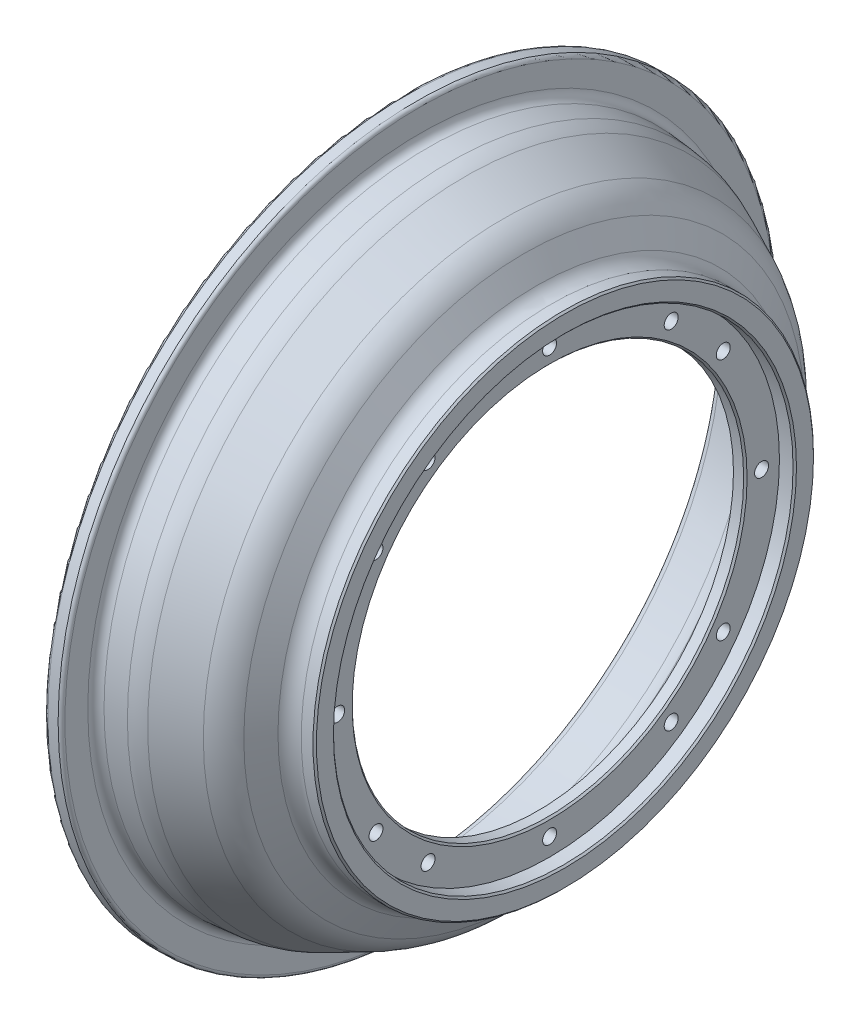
ISO-10303-21;
HEADER;
FILE_DESCRIPTION(('STEP AP214'),'2;1');
FILE_NAME('part.step','',(''),(''),'','','');
FILE_SCHEMA(('AUTOMOTIVE_DESIGN { 1 0 10303 214 1 1 1 1 }'));
ENDSEC;
DATA;
#1=APPLICATION_CONTEXT('core data for automotive mechanical design processes');
#2=APPLICATION_PROTOCOL_DEFINITION('international standard','automotive_design',2000,#1);
#3=PRODUCT_CONTEXT('',#1,'mechanical');
#4=PRODUCT('Part','Part','',(#3));
#5=PRODUCT_RELATED_PRODUCT_CATEGORY('part','',(#4));
#6=PRODUCT_DEFINITION_FORMATION('','',#4);
#7=PRODUCT_DEFINITION_CONTEXT('part definition',#1,'design');
#8=PRODUCT_DEFINITION('design','',#6,#7);
#9=PRODUCT_DEFINITION_SHAPE('','',#8);
#10=(LENGTH_UNIT() NAMED_UNIT(*) SI_UNIT(.MILLI.,.METRE.));
#11=(NAMED_UNIT(*) PLANE_ANGLE_UNIT() SI_UNIT($,.RADIAN.));
#12=(NAMED_UNIT(*) SI_UNIT($,.STERADIAN.) SOLID_ANGLE_UNIT());
#13=UNCERTAINTY_MEASURE_WITH_UNIT(LENGTH_MEASURE(1.E-05),#10,'distance_accuracy_value','');
#14=(GEOMETRIC_REPRESENTATION_CONTEXT(3) GLOBAL_UNCERTAINTY_ASSIGNED_CONTEXT((#13)) GLOBAL_UNIT_ASSIGNED_CONTEXT((#10,
#11,#12)) REPRESENTATION_CONTEXT('',''));
#15=CARTESIAN_POINT('',(0.,0.,0.));
#16=DIRECTION('',(0.,0.,1.));
#17=DIRECTION('',(1.,0.,0.));
#18=AXIS2_PLACEMENT_3D('',#15,#16,#17);
#19=CARTESIAN_POINT('',(0.,135.,0.));
#20=DIRECTION('',(1.,0.,0.));
#21=DIRECTION('',(0.,0.,-1.));
#22=AXIS2_PLACEMENT_3D('',#19,#20,#21);
#23=PLANE('',#22);
#24=CARTESIAN_POINT('',(0.,0.,0.));
#25=DIRECTION('',(1.,0.,0.));
#26=DIRECTION('',(0.,0.,-1.));
#27=AXIS2_PLACEMENT_3D('',#24,#25,#26);
#28=CIRCLE('',#27,136.);
#29=CARTESIAN_POINT('',(0.,0.,-136.));
#30=VERTEX_POINT('',#29);
#31=EDGE_CURVE('E87',#30,#30,#28,.F.);
#32=ORIENTED_EDGE('',*,*,#31,.T.);
#33=EDGE_LOOP('',(#32));
#34=FACE_BOUND('',#33,.T.);
#35=CARTESIAN_POINT('',(0.,0.,0.));
#36=DIRECTION('',(1.,0.,0.));
#37=DIRECTION('',(0.,0.,-1.));
#38=AXIS2_PLACEMENT_3D('',#35,#36,#37);
#39=CIRCLE('',#38,146.);
#40=CARTESIAN_POINT('',(0.,0.,-146.));
#41=VERTEX_POINT('',#40);
#42=EDGE_CURVE('E90',#41,#41,#39,.T.);
#43=ORIENTED_EDGE('',*,*,#42,.T.);
#44=EDGE_LOOP('',(#43));
#45=FACE_BOUND('',#44,.T.);
#46=ADVANCED_FACE('F41',(#34,#45),#23,.T.);
#47=CARTESIAN_POINT('',(0.,0.,0.));
#48=DIRECTION('',(1.,0.,0.));
#49=DIRECTION('',(0.,0.,-1.));
#50=AXIS2_PLACEMENT_3D('',#47,#48,#49);
#51=CYLINDRICAL_SURFACE('',#50,135.);
#52=CARTESIAN_POINT('',(-1.0000000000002,0.,0.));
#53=DIRECTION('',(1.,0.,0.));
#54=DIRECTION('',(0.,0.,-1.));
#55=AXIS2_PLACEMENT_3D('',#52,#53,#54);
#56=CIRCLE('',#55,135.);
#57=CARTESIAN_POINT('',(-1.0000000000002,0.,-135.));
#58=VERTEX_POINT('',#57);
#59=EDGE_CURVE('E93',#58,#58,#56,.T.);
#60=ORIENTED_EDGE('',*,*,#59,.T.);
#61=EDGE_LOOP('',(#60));
#62=FACE_BOUND('',#61,.T.);
#63=CARTESIAN_POINT('',(-9.,0.,0.));
#64=DIRECTION('',(1.,0.,0.));
#65=DIRECTION('',(0.,0.,-1.));
#66=AXIS2_PLACEMENT_3D('',#63,#64,#65);
#67=CIRCLE('',#66,135.);
#68=CARTESIAN_POINT('',(-9.,0.,-135.));
#69=VERTEX_POINT('',#68);
#70=EDGE_CURVE('E132',#69,#69,#67,.T.);
#71=ORIENTED_EDGE('',*,*,#70,.F.);
#72=EDGE_LOOP('',(#71));
#73=FACE_BOUND('',#72,.T.);
#74=ADVANCED_FACE('F311',(#62,#73),#51,.F.);
#75=CARTESIAN_POINT('',(-9.,135.,0.));
#76=DIRECTION('',(1.,0.,0.));
#77=DIRECTION('',(0.,0.,-1.));
#78=AXIS2_PLACEMENT_3D('',#75,#76,#77);
#79=PLANE('',#78);
#80=CARTESIAN_POINT('',(-9.,0.,0.));
#81=DIRECTION('',(1.,0.,0.));
#82=DIRECTION('',(0.,0.,-1.));
#83=AXIS2_PLACEMENT_3D('',#80,#81,#82);
#84=CIRCLE('',#83,116.);
#85=CARTESIAN_POINT('',(-9.,0.,-116.));
#86=VERTEX_POINT('',#85);
#87=EDGE_CURVE('E96',#86,#86,#84,.F.);
#88=ORIENTED_EDGE('',*,*,#87,.T.);
#89=EDGE_LOOP('',(#88));
#90=FACE_BOUND('',#89,.T.);
#91=CARTESIAN_POINT('',(-9.,-4.3468942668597E-13,124.5));
#92=DIRECTION('',(1.,0.,0.));
#93=DIRECTION('',(0.,0.,-1.));
#94=AXIS2_PLACEMENT_3D('',#91,#92,#93);
#95=CIRCLE('',#94,4.1);
#96=CARTESIAN_POINT('',(-9.,-4.3468942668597E-13,120.4));
#97=VERTEX_POINT('',#96);
#98=EDGE_CURVE('E152',#97,#97,#95,.T.);
#99=ORIENTED_EDGE('',*,*,#98,.F.);
#100=EDGE_LOOP('',(#99));
#101=FACE_BOUND('',#100,.T.);
#102=CARTESIAN_POINT('',(-9.,101.98442951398,-71.4102663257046));
#103=DIRECTION('',(1.,0.,0.));
#104=DIRECTION('',(0.,0.,-1.));
#105=AXIS2_PLACEMENT_3D('',#102,#103,#104);
#106=CIRCLE('',#105,4.1);
#107=CARTESIAN_POINT('',(-9.,101.98442951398,-75.5102663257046));
#108=VERTEX_POINT('',#107);
#109=EDGE_CURVE('E159',#108,#108,#106,.T.);
#110=ORIENTED_EDGE('',*,*,#109,.F.);
#111=EDGE_LOOP('',(#110));
#112=FACE_BOUND('',#111,.T.);
#113=CARTESIAN_POINT('',(-9.,71.4102663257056,-101.984429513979));
#114=DIRECTION('',(1.,0.,0.));
#115=DIRECTION('',(0.,0.,-1.));
#116=AXIS2_PLACEMENT_3D('',#113,#114,#115);
#117=CIRCLE('',#116,4.1);
#118=CARTESIAN_POINT('',(-9.,71.4102663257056,-106.084429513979));
#119=VERTEX_POINT('',#118);
#120=EDGE_CURVE('E162',#119,#119,#117,.T.);
#121=ORIENTED_EDGE('',*,*,#120,.F.);
#122=EDGE_LOOP('',(#121));
#123=FACE_BOUND('',#122,.T.);
#124=CARTESIAN_POINT('',(-9.,1.30406828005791E-12,-124.5));
#125=DIRECTION('',(1.,0.,0.));
#126=DIRECTION('',(0.,0.,-1.));
#127=AXIS2_PLACEMENT_3D('',#124,#125,#126);
#128=CIRCLE('',#127,4.1);
#129=CARTESIAN_POINT('',(-9.,1.30406828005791E-12,-128.6));
#130=VERTEX_POINT('',#129);
#131=EDGE_CURVE('E165',#130,#130,#128,.T.);
#132=ORIENTED_EDGE('',*,*,#131,.F.);
#133=EDGE_LOOP('',(#132));
#134=FACE_BOUND('',#133,.T.);
#135=CARTESIAN_POINT('',(-9.,-71.4102663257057,-101.984429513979));
#136=DIRECTION('',(1.,0.,0.));
#137=DIRECTION('',(0.,0.,-1.));
#138=AXIS2_PLACEMENT_3D('',#135,#136,#137);
#139=CIRCLE('',#138,4.1);
#140=CARTESIAN_POINT('',(-9.,-71.4102663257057,-106.084429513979));
#141=VERTEX_POINT('',#140);
#142=EDGE_CURVE('E168',#141,#141,#139,.T.);
#143=ORIENTED_EDGE('',*,*,#142,.F.);
#144=EDGE_LOOP('',(#143));
#145=FACE_BOUND('',#144,.T.);
#146=CARTESIAN_POINT('',(-9.,-101.98442951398,-71.4102663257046));
#147=DIRECTION('',(1.,0.,0.));
#148=DIRECTION('',(0.,0.,-1.));
#149=AXIS2_PLACEMENT_3D('',#146,#147,#148);
#150=CIRCLE('',#149,4.1);
#151=CARTESIAN_POINT('',(-9.,-101.98442951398,-75.5102663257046));
#152=VERTEX_POINT('',#151);
#153=EDGE_CURVE('E171',#152,#152,#150,.T.);
#154=ORIENTED_EDGE('',*,*,#153,.F.);
#155=EDGE_LOOP('',(#154));
#156=FACE_BOUND('',#155,.T.);
#157=CARTESIAN_POINT('',(-9.,-124.5,0.));
#158=DIRECTION('',(1.,0.,0.));
#159=DIRECTION('',(0.,0.,-1.));
#160=AXIS2_PLACEMENT_3D('',#157,#158,#159);
#161=CIRCLE('',#160,4.1);
#162=CARTESIAN_POINT('',(-9.,-124.5,-4.1));
#163=VERTEX_POINT('',#162);
#164=EDGE_CURVE('E174',#163,#163,#161,.T.);
#165=ORIENTED_EDGE('',*,*,#164,.F.);
#166=EDGE_LOOP('',(#165));
#167=FACE_BOUND('',#166,.T.);
#168=CARTESIAN_POINT('',(-9.,-101.984429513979,71.4102663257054));
#169=DIRECTION('',(1.,0.,0.));
#170=DIRECTION('',(0.,0.,-1.));
#171=AXIS2_PLACEMENT_3D('',#168,#169,#170);
#172=CIRCLE('',#171,4.1);
#173=CARTESIAN_POINT('',(-9.,-101.984429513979,67.3102663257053));
#174=VERTEX_POINT('',#173);
#175=EDGE_CURVE('E177',#174,#174,#172,.T.);
#176=ORIENTED_EDGE('',*,*,#175,.F.);
#177=EDGE_LOOP('',(#176));
#178=FACE_BOUND('',#177,.T.);
#179=CARTESIAN_POINT('',(-9.,-71.4102663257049,101.98442951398));
#180=DIRECTION('',(1.,0.,0.));
#181=DIRECTION('',(0.,0.,-1.));
#182=AXIS2_PLACEMENT_3D('',#179,#180,#181);
#183=CIRCLE('',#182,4.1);
#184=CARTESIAN_POINT('',(-9.,-71.4102663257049,97.8844295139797));
#185=VERTEX_POINT('',#184);
#186=EDGE_CURVE('E180',#185,#185,#183,.T.);
#187=ORIENTED_EDGE('',*,*,#186,.F.);
#188=EDGE_LOOP('',(#187));
#189=FACE_BOUND('',#188,.T.);
#190=CARTESIAN_POINT('',(-9.,124.5,0.));
#191=DIRECTION('',(1.,0.,0.));
#192=DIRECTION('',(0.,0.,-1.));
#193=AXIS2_PLACEMENT_3D('',#190,#191,#192);
#194=CIRCLE('',#193,4.1);
#195=CARTESIAN_POINT('',(-9.,124.5,-4.1));
#196=VERTEX_POINT('',#195);
#197=EDGE_CURVE('E138',#196,#196,#194,.T.);
#198=ORIENTED_EDGE('',*,*,#197,.F.);
#199=EDGE_LOOP('',(#198));
#200=FACE_BOUND('',#199,.T.);
#201=CARTESIAN_POINT('',(-9.,101.98442951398,71.4102663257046));
#202=DIRECTION('',(1.,0.,0.));
#203=DIRECTION('',(0.,0.,-1.));
#204=AXIS2_PLACEMENT_3D('',#201,#202,#203);
#205=CIRCLE('',#204,4.1);
#206=CARTESIAN_POINT('',(-9.,101.98442951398,67.3102663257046));
#207=VERTEX_POINT('',#206);
#208=EDGE_CURVE('E141',#207,#207,#205,.T.);
#209=ORIENTED_EDGE('',*,*,#208,.F.);
#210=EDGE_LOOP('',(#209));
#211=FACE_BOUND('',#210,.T.);
#212=CARTESIAN_POINT('',(-9.,71.4102663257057,101.984429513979));
#213=DIRECTION('',(1.,0.,0.));
#214=DIRECTION('',(0.,0.,-1.));
#215=AXIS2_PLACEMENT_3D('',#212,#213,#214);
#216=CIRCLE('',#215,4.1);
#217=CARTESIAN_POINT('',(-9.,71.4102663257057,97.8844295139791));
#218=VERTEX_POINT('',#217);
#219=EDGE_CURVE('E144',#218,#218,#216,.T.);
#220=ORIENTED_EDGE('',*,*,#219,.F.);
#221=EDGE_LOOP('',(#220));
#222=FACE_BOUND('',#221,.T.);
#223=ORIENTED_EDGE('',*,*,#70,.T.);
#224=EDGE_LOOP('',(#223));
#225=FACE_BOUND('',#224,.T.);
#226=ADVANCED_FACE('F317',(#90,#101,#112,#123,#134,#145,#156,#167,#178,#189,#200,#211,#222,
#225),#79,.T.);
#227=CARTESIAN_POINT('',(0.,0.,0.));
#228=DIRECTION('',(1.,0.,0.));
#229=DIRECTION('',(0.,0.,-1.));
#230=AXIS2_PLACEMENT_3D('',#227,#228,#229);
#231=CYLINDRICAL_SURFACE('',#230,115.);
#232=CARTESIAN_POINT('',(-10.,0.,0.));
#233=DIRECTION('',(1.,0.,0.));
#234=DIRECTION('',(0.,0.,-1.));
#235=AXIS2_PLACEMENT_3D('',#232,#233,#234);
#236=CIRCLE('',#235,115.);
#237=CARTESIAN_POINT('',(-10.,0.,-115.));
#238=VERTEX_POINT('',#237);
#239=EDGE_CURVE('E99',#238,#238,#236,.T.);
#240=ORIENTED_EDGE('',*,*,#239,.T.);
#241=EDGE_LOOP('',(#240));
#242=FACE_BOUND('',#241,.T.);
#243=CARTESIAN_POINT('',(-16.,0.,0.));
#244=DIRECTION('',(1.,0.,0.));
#245=DIRECTION('',(0.,0.,-1.));
#246=AXIS2_PLACEMENT_3D('',#243,#244,#245);
#247=CIRCLE('',#246,115.);
#248=CARTESIAN_POINT('',(-16.,0.,-115.));
#249=VERTEX_POINT('',#248);
#250=EDGE_CURVE('E135',#249,#249,#247,.T.);
#251=ORIENTED_EDGE('',*,*,#250,.F.);
#252=EDGE_LOOP('',(#251));
#253=FACE_BOUND('',#252,.T.);
#254=ADVANCED_FACE('F429',(#242,#253),#231,.F.);
#255=CARTESIAN_POINT('',(-16.,115.,0.));
#256=DIRECTION('',(-1.,0.,0.));
#257=DIRECTION('',(0.,0.,1.));
#258=AXIS2_PLACEMENT_3D('',#255,#256,#257);
#259=PLANE('',#258);
#260=CARTESIAN_POINT('',(-16.,0.,0.));
#261=DIRECTION('',(-1.,0.,0.));
#262=DIRECTION('',(0.,0.,1.));
#263=AXIS2_PLACEMENT_3D('',#260,#261,#262);
#264=CIRCLE('',#263,133.392304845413);
#265=CARTESIAN_POINT('',(-16.,0.,133.392304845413));
#266=VERTEX_POINT('',#265);
#267=EDGE_CURVE('E78',#266,#266,#264,.T.);
#268=ORIENTED_EDGE('',*,*,#267,.T.);
#269=EDGE_LOOP('',(#268));
#270=FACE_BOUND('',#269,.T.);
#271=CARTESIAN_POINT('',(-16.,-4.3468942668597E-13,124.5));
#272=DIRECTION('',(-1.,0.,0.));
#273=DIRECTION('',(0.,-1.,0.));
#274=AXIS2_PLACEMENT_3D('',#271,#272,#273);
#275=CIRCLE('',#274,4.1);
#276=CARTESIAN_POINT('',(-16.,-4.10000000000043,124.5));
#277=VERTEX_POINT('',#276);
#278=EDGE_CURVE('E183',#277,#277,#275,.T.);
#279=ORIENTED_EDGE('',*,*,#278,.F.);
#280=EDGE_LOOP('',(#279));
#281=FACE_BOUND('',#280,.T.);
#282=CARTESIAN_POINT('',(-16.,101.98442951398,-71.4102663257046));
#283=DIRECTION('',(-1.,0.,0.));
#284=DIRECTION('',(0.,1.,0.));
#285=AXIS2_PLACEMENT_3D('',#282,#283,#284);
#286=CIRCLE('',#285,4.1);
#287=CARTESIAN_POINT('',(-16.,106.08442951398,-71.4102663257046));
#288=VERTEX_POINT('',#287);
#289=EDGE_CURVE('E197',#288,#288,#286,.T.);
#290=ORIENTED_EDGE('',*,*,#289,.F.);
#291=EDGE_LOOP('',(#290));
#292=FACE_BOUND('',#291,.T.);
#293=CARTESIAN_POINT('',(-16.,71.4102663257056,-101.984429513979));
#294=DIRECTION('',(-1.,0.,0.));
#295=DIRECTION('',(0.,1.,0.));
#296=AXIS2_PLACEMENT_3D('',#293,#294,#295);
#297=CIRCLE('',#296,4.1);
#298=CARTESIAN_POINT('',(-16.,75.5102663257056,-101.984429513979));
#299=VERTEX_POINT('',#298);
#300=EDGE_CURVE('E200',#299,#299,#297,.T.);
#301=ORIENTED_EDGE('',*,*,#300,.F.);
#302=EDGE_LOOP('',(#301));
#303=FACE_BOUND('',#302,.T.);
#304=CARTESIAN_POINT('',(-16.,1.30406828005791E-12,-124.5));
#305=DIRECTION('',(-1.,0.,0.));
#306=DIRECTION('',(0.,1.,0.));
#307=AXIS2_PLACEMENT_3D('',#304,#305,#306);
#308=CIRCLE('',#307,4.1);
#309=CARTESIAN_POINT('',(-16.,4.1000000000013,-124.5));
#310=VERTEX_POINT('',#309);
#311=EDGE_CURVE('E204',#310,#310,#308,.T.);
#312=ORIENTED_EDGE('',*,*,#311,.F.);
#313=EDGE_LOOP('',(#312));
#314=FACE_BOUND('',#313,.T.);
#315=CARTESIAN_POINT('',(-16.,-71.4102663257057,-101.984429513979));
#316=DIRECTION('',(-1.,0.,0.));
#317=DIRECTION('',(0.,0.,-1.));
#318=AXIS2_PLACEMENT_3D('',#315,#316,#317);
#319=CIRCLE('',#318,4.1);
#320=CARTESIAN_POINT('',(-16.,-71.4102663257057,-106.084429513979));
#321=VERTEX_POINT('',#320);
#322=EDGE_CURVE('E188',#321,#321,#319,.T.);
#323=ORIENTED_EDGE('',*,*,#322,.F.);
#324=EDGE_LOOP('',(#323));
#325=FACE_BOUND('',#324,.T.);
#326=CARTESIAN_POINT('',(-16.,-101.98442951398,-71.4102663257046));
#327=DIRECTION('',(-1.,0.,0.));
#328=DIRECTION('',(0.,0.,-1.));
#329=AXIS2_PLACEMENT_3D('',#326,#327,#328);
#330=CIRCLE('',#329,4.1);
#331=CARTESIAN_POINT('',(-16.,-101.98442951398,-75.5102663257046));
#332=VERTEX_POINT('',#331);
#333=EDGE_CURVE('E184',#332,#332,#330,.T.);
#334=ORIENTED_EDGE('',*,*,#333,.F.);
#335=EDGE_LOOP('',(#334));
#336=FACE_BOUND('',#335,.T.);
#337=CARTESIAN_POINT('',(-16.,-124.5,0.));
#338=DIRECTION('',(-1.,0.,0.));
#339=DIRECTION('',(0.,0.,-1.));
#340=AXIS2_PLACEMENT_3D('',#337,#338,#339);
#341=CIRCLE('',#340,4.1);
#342=CARTESIAN_POINT('',(-16.,-124.5,-4.1));
#343=VERTEX_POINT('',#342);
#344=EDGE_CURVE('E187',#343,#343,#341,.T.);
#345=ORIENTED_EDGE('',*,*,#344,.F.);
#346=EDGE_LOOP('',(#345));
#347=FACE_BOUND('',#346,.T.);
#348=CARTESIAN_POINT('',(-16.,-101.984429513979,71.4102663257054));
#349=DIRECTION('',(-1.,0.,0.));
#350=DIRECTION('',(0.,-1.,0.));
#351=AXIS2_PLACEMENT_3D('',#348,#349,#350);
#352=CIRCLE('',#351,4.1);
#353=CARTESIAN_POINT('',(-16.,-106.084429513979,71.4102663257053));
#354=VERTEX_POINT('',#353);
#355=EDGE_CURVE('E191',#354,#354,#352,.T.);
#356=ORIENTED_EDGE('',*,*,#355,.F.);
#357=EDGE_LOOP('',(#356));
#358=FACE_BOUND('',#357,.T.);
#359=CARTESIAN_POINT('',(-16.,-71.4102663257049,101.98442951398));
#360=DIRECTION('',(-1.,0.,0.));
#361=DIRECTION('',(0.,-1.,0.));
#362=AXIS2_PLACEMENT_3D('',#359,#360,#361);
#363=CIRCLE('',#362,4.1);
#364=CARTESIAN_POINT('',(-16.,-75.5102663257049,101.98442951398));
#365=VERTEX_POINT('',#364);
#366=EDGE_CURVE('E194',#365,#365,#363,.T.);
#367=ORIENTED_EDGE('',*,*,#366,.F.);
#368=EDGE_LOOP('',(#367));
#369=FACE_BOUND('',#368,.T.);
#370=CARTESIAN_POINT('',(-16.,124.5,0.));
#371=DIRECTION('',(-1.,0.,0.));
#372=DIRECTION('',(0.,0.,1.));
#373=AXIS2_PLACEMENT_3D('',#370,#371,#372);
#374=CIRCLE('',#373,4.1);
#375=CARTESIAN_POINT('',(-16.,124.5,4.1));
#376=VERTEX_POINT('',#375);
#377=EDGE_CURVE('E147',#376,#376,#374,.T.);
#378=ORIENTED_EDGE('',*,*,#377,.F.);
#379=EDGE_LOOP('',(#378));
#380=FACE_BOUND('',#379,.T.);
#381=CARTESIAN_POINT('',(-16.,101.98442951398,71.4102663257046));
#382=DIRECTION('',(-1.,0.,0.));
#383=DIRECTION('',(0.,0.,1.));
#384=AXIS2_PLACEMENT_3D('',#381,#382,#383);
#385=CIRCLE('',#384,4.1);
#386=CARTESIAN_POINT('',(-16.,101.98442951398,75.5102663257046));
#387=VERTEX_POINT('',#386);
#388=EDGE_CURVE('E151',#387,#387,#385,.T.);
#389=ORIENTED_EDGE('',*,*,#388,.F.);
#390=EDGE_LOOP('',(#389));
#391=FACE_BOUND('',#390,.T.);
#392=CARTESIAN_POINT('',(-16.,71.4102663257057,101.984429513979));
#393=DIRECTION('',(-1.,0.,0.));
#394=DIRECTION('',(0.,0.,1.));
#395=AXIS2_PLACEMENT_3D('',#392,#393,#394);
#396=CIRCLE('',#395,4.1);
#397=CARTESIAN_POINT('',(-16.,71.4102663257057,106.084429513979));
#398=VERTEX_POINT('',#397);
#399=EDGE_CURVE('E148',#398,#398,#396,.T.);
#400=ORIENTED_EDGE('',*,*,#399,.F.);
#401=EDGE_LOOP('',(#400));
#402=FACE_BOUND('',#401,.T.);
#403=ORIENTED_EDGE('',*,*,#250,.T.);
#404=EDGE_LOOP('',(#403));
#405=FACE_BOUND('',#404,.T.);
#406=ADVANCED_FACE('F422',(#270,#281,#292,#303,#314,#325,#336,#347,#358,#369,#380,#391,#402,
#405),#259,.T.);
#407=CARTESIAN_POINT('',(-33.9952238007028,0.,0.));
#408=DIRECTION('',(-1.,0.,0.));
#409=DIRECTION('',(0.,0.,1.));
#410=AXIS2_PLACEMENT_3D('',#407,#408,#409);
#411=CONICAL_SURFACE('',#410,166.16864191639,1.0471975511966);
#412=CARTESIAN_POINT('',(-16.8038475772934,0.,0.));
#413=DIRECTION('',(-1.,0.,0.));
#414=DIRECTION('',(0.,0.,1.));
#415=AXIS2_PLACEMENT_3D('',#412,#413,#414);
#416=CIRCLE('',#415,136.392304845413);
#417=CARTESIAN_POINT('',(-16.8038475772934,0.,136.392304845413));
#418=VERTEX_POINT('',#417);
#419=EDGE_CURVE('E81',#418,#418,#416,.F.);
#420=ORIENTED_EDGE('',*,*,#419,.T.);
#421=EDGE_LOOP('',(#420));
#422=FACE_BOUND('',#421,.T.);
#423=CARTESIAN_POINT('',(-30.8422359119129,0.,0.));
#424=DIRECTION('',(-1.,0.,0.));
#425=DIRECTION('',(0.,0.,1.));
#426=AXIS2_PLACEMENT_3D('',#423,#424,#425);
#427=CIRCLE('',#426,160.707506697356);
#428=CARTESIAN_POINT('',(-30.8422359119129,0.,160.707506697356));
#429=VERTEX_POINT('',#428);
#430=EDGE_CURVE('E120',#429,#429,#427,.T.);
#431=ORIENTED_EDGE('',*,*,#430,.T.);
#432=EDGE_LOOP('',(#431));
#433=FACE_BOUND('',#432,.T.);
#434=ADVANCED_FACE('F307',(#422,#433),#411,.F.);
#435=CARTESIAN_POINT('',(-65.2,0.,0.));
#436=DIRECTION('',(-1.,0.,0.));
#437=DIRECTION('',(0.,0.,1.));
#438=AXIS2_PLACEMENT_3D('',#435,#436,#437);
#439=CONICAL_SURFACE('',#438,180.719668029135,0.436332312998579);
#440=CARTESIAN_POINT('',(-56.0266463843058,-1.87432316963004,-176.432107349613));
#441=CARTESIAN_POINT('',(-55.9795709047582,-2.03446837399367,-176.408453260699));
#442=CARTESIAN_POINT('',(-55.9264549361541,-2.19237160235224,-176.381786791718));
#443=CARTESIAN_POINT('',(-55.8084796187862,-2.50266424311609,-176.322638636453));
#444=CARTESIAN_POINT('',(-55.7436172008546,-2.65505220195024,-176.290155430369));
#445=CARTESIAN_POINT('',(-55.6025418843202,-2.95330771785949,-176.219617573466));
#446=CARTESIAN_POINT('',(-55.5263189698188,-3.09916937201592,-176.181558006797));
#447=CARTESIAN_POINT('',(-55.3630572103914,-3.38324681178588,-176.100187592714));
#448=CARTESIAN_POINT('',(-55.2760144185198,-3.52145978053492,-176.056874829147));
#449=CARTESIAN_POINT('',(-55.0918119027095,-3.78908366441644,-175.965403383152));
#450=CARTESIAN_POINT('',(-54.994660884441,-3.91850199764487,-175.917248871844));
#451=CARTESIAN_POINT('',(-54.7908101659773,-4.16779337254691,-175.816435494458));
#452=CARTESIAN_POINT('',(-54.6841069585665,-4.28766287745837,-175.763774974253));
#453=CARTESIAN_POINT('',(-54.4619859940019,-4.51688091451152,-175.65442283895));
#454=CARTESIAN_POINT('',(-54.3465736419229,-4.62623587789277,-175.597733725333));
#455=CARTESIAN_POINT('',(-54.1077285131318,-4.83377036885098,-175.480725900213));
#456=CARTESIAN_POINT('',(-53.9842927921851,-4.93194575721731,-175.420405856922));
#457=CARTESIAN_POINT('',(-53.7303085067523,-5.11636567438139,-175.296638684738));
#458=CARTESIAN_POINT('',(-53.5997607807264,-5.202611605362,-175.23319192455));
#459=CARTESIAN_POINT('',(-53.3323960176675,-5.36260253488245,-175.103636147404));
#460=CARTESIAN_POINT('',(-53.1955766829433,-5.43634290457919,-175.037526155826));
#461=CARTESIAN_POINT('',(-52.9167136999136,-5.57073630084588,-174.903198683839));
#462=CARTESIAN_POINT('',(-52.7746717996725,-5.63139366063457,-174.8349819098));
#463=CARTESIAN_POINT('',(-52.4862611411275,-5.73923996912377,-174.696914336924));
#464=CARTESIAN_POINT('',(-52.3398908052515,-5.78642393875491,-174.627062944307));
#465=CARTESIAN_POINT('',(-52.044001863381,-5.86692913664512,-174.486323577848));
#466=CARTESIAN_POINT('',(-51.894485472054,-5.90025979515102,-174.415436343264));
#467=CARTESIAN_POINT('',(-51.5932090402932,-5.95287806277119,-174.273079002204));
#468=CARTESIAN_POINT('',(-51.4414481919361,-5.97216048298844,-174.201608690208));
#469=CARTESIAN_POINT('',(-51.1368539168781,-5.99651538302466,-174.0586532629));
#470=CARTESIAN_POINT('',(-50.9840209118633,-6.00159316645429,-173.987168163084));
#471=CARTESIAN_POINT('',(-50.6783068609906,-5.99753402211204,-173.844666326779));
#472=CARTESIAN_POINT('',(-50.5254258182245,-5.98839184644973,-173.773649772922));
#473=CARTESIAN_POINT('',(-50.0685793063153,-5.93967799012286,-173.562169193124));
#474=CARTESIAN_POINT('',(-49.7659638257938,-5.87885422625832,-173.423064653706));
#475=CARTESIAN_POINT('',(-49.1737771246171,-5.70220948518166,-173.152671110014));
#476=CARTESIAN_POINT('',(-48.8842058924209,-5.58638855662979,-173.021382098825));
#477=CARTESIAN_POINT('',(-48.3261907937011,-5.30302346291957,-172.769969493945));
#478=CARTESIAN_POINT('',(-48.0577496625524,-5.13547261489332,-172.649847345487));
#479=CARTESIAN_POINT('',(-47.5498635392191,-4.7534079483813,-172.423867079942));
#480=CARTESIAN_POINT('',(-47.3104186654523,-4.53889393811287,-172.318009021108));
#481=CARTESIAN_POINT('',(-46.8673860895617,-4.06888060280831,-172.123100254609));
#482=CARTESIAN_POINT('',(-46.6638141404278,-3.81336336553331,-172.034056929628));
#483=CARTESIAN_POINT('',(-46.2986284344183,-3.26865602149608,-171.874948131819));
#484=CARTESIAN_POINT('',(-46.1370146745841,-2.97946591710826,-171.804882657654));
#485=CARTESIAN_POINT('',(-45.8605010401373,-2.3755970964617,-171.685340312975));
#486=CARTESIAN_POINT('',(-45.7456038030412,-2.06091694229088,-171.635864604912));
#487=CARTESIAN_POINT('',(-45.5659418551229,-1.41501568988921,-171.558623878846));
#488=CARTESIAN_POINT('',(-45.5011770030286,-1.08379463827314,-171.530858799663));
#489=CARTESIAN_POINT('',(-45.423721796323,-0.414363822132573,-171.497663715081));
#490=CARTESIAN_POINT('',(-45.4110094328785,-0.0761570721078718,-171.492224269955));
#491=CARTESIAN_POINT('',(-45.4379770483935,0.597775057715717,-171.503774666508));
#492=CARTESIAN_POINT('',(-45.4776569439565,0.933500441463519,-171.520764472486));
#493=CARTESIAN_POINT('',(-45.608213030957,1.59285871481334,-171.576790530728));
#494=CARTESIAN_POINT('',(-45.6990771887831,1.91649442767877,-171.615821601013));
#495=CARTESIAN_POINT('',(-45.9292987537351,2.54257856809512,-171.715053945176));
#496=CARTESIAN_POINT('',(-46.06865627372,2.8450269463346,-171.775255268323));
#497=CARTESIAN_POINT('',(-46.3918033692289,3.42025953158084,-171.915481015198));
#498=CARTESIAN_POINT('',(-46.5756074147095,3.69303403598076,-171.995511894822));
#499=CARTESIAN_POINT('',(-46.9822236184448,4.2010757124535,-172.173518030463));
#500=CARTESIAN_POINT('',(-47.2050358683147,4.43634279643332,-172.271493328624));
#501=CARTESIAN_POINT('',(-47.6832481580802,4.86277972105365,-172.483067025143));
#502=CARTESIAN_POINT('',(-47.9386602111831,5.05393323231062,-172.596671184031));
#503=CARTESIAN_POINT('',(-48.4745852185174,5.38660260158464,-172.836637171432));
#504=CARTESIAN_POINT('',(-48.7550981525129,5.52811849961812,-172.962998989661));
#505=CARTESIAN_POINT('',(-49.3330680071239,5.75747100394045,-173.225177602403));
#506=CARTESIAN_POINT('',(-49.6305220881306,5.84531657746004,-173.360992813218));
#507=CARTESIAN_POINT('',(-50.2338908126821,5.96485718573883,-173.638442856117));
#508=CARTESIAN_POINT('',(-50.5398054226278,5.99655244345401,-173.780077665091));
#509=CARTESIAN_POINT('',(-51.1511888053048,6.00291454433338,-174.065120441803));
#510=CARTESIAN_POINT('',(-51.4566577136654,5.97760605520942,-174.208527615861));
#511=CARTESIAN_POINT('',(-52.0588361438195,5.87063587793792,-174.49312465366));
#512=CARTESIAN_POINT('',(-52.3555456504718,5.7889740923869,-174.634314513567));
#513=CARTESIAN_POINT('',(-52.7874110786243,5.62617190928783,-174.841093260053));
#514=CARTESIAN_POINT('',(-52.9292375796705,5.5651435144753,-174.909219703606));
#515=CARTESIAN_POINT('',(-53.2075887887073,5.43007055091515,-175.043325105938));
#516=CARTESIAN_POINT('',(-53.3441154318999,5.35603078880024,-175.109304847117));
#517=CARTESIAN_POINT('',(-53.6109685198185,5.19542404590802,-175.238633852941));
#518=CARTESIAN_POINT('',(-53.7412926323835,5.10885240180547,-175.301982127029));
#519=CARTESIAN_POINT('',(-53.9947495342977,4.9238499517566,-175.425511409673));
#520=CARTESIAN_POINT('',(-54.1178849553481,4.82542352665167,-175.485693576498));
#521=CARTESIAN_POINT('',(-54.3562578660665,4.61730138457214,-175.602486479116));
#522=CARTESIAN_POINT('',(-54.4714889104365,4.50759664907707,-175.659094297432));
#523=CARTESIAN_POINT('',(-54.6931087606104,4.27780565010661,-175.768214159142));
#524=CARTESIAN_POINT('',(-54.7995008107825,4.15772322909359,-175.820727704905));
#525=CARTESIAN_POINT('',(-55.0027915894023,3.90795304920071,-175.921276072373));
#526=CARTESIAN_POINT('',(-55.0996871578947,3.77826211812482,-175.96930940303));
#527=CARTESIAN_POINT('',(-55.2832452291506,3.51028073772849,-176.060470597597));
#528=CARTESIAN_POINT('',(-55.3699114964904,3.37199348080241,-176.103600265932));
#529=CARTESIAN_POINT('',(-55.5324966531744,3.08769075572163,-176.184640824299));
#530=CARTESIAN_POINT('',(-55.6084104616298,2.94167167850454,-176.22254924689));
#531=CARTESIAN_POINT('',(-55.7488959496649,2.6430580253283,-176.292797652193));
#532=CARTESIAN_POINT('',(-55.8134718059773,2.4904658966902,-176.325139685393));
#533=CARTESIAN_POINT('',(-55.930909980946,2.17964413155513,-176.384022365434));
#534=CARTESIAN_POINT('',(-55.9837650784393,2.0214110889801,-176.410559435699));
#535=CARTESIAN_POINT('',(-56.0773319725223,1.70058159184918,-176.45757681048));
#536=CARTESIAN_POINT('',(-56.1180482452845,1.5379867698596,-176.478059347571));
#537=CARTESIAN_POINT('',(-56.1871033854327,1.20944754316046,-176.512818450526));
#538=CARTESIAN_POINT('',(-56.2154357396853,1.04350142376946,-176.527091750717));
#539=CARTESIAN_POINT('',(-56.2594900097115,0.709586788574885,-176.549292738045));
#540=CARTESIAN_POINT('',(-56.2752165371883,0.541619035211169,-176.557222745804));
#541=CARTESIAN_POINT('',(-56.2939599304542,0.204942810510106,-176.566674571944));
#542=CARTESIAN_POINT('',(-56.2969880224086,0.0362351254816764,-176.568202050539));
#543=CARTESIAN_POINT('',(-56.2903480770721,-0.300811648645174,-176.564853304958));
#544=CARTESIAN_POINT('',(-56.2806833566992,-0.469150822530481,-176.559978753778));
#545=CARTESIAN_POINT('',(-56.24466136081,-0.846922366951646,-176.541818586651));
#546=CARTESIAN_POINT('',(-56.214688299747,-1.05593407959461,-176.526711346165));
#547=CARTESIAN_POINT('',(-56.1351904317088,-1.46924623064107,-176.486683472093));
#548=CARTESIAN_POINT('',(-56.0856656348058,-1.67354667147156,-176.461762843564));
#549=CARTESIAN_POINT('',(-56.0266463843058,-1.87432316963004,-176.432107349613));
#550=B_SPLINE_CURVE_WITH_KNOTS('',3,(#440,#441,#442,#443,#444,#445,#446,#447,#448,#449,#450,
#451,#452,#453,#454,#455,#456,#457,#458,#459,#460,#461,#462,#463,#464,#465,#466,#467,#468,#469,
#470,#471,#472,#473,#474,#475,#476,#477,#478,#479,#480,#481,#482,#483,#484,#485,#486,#487,#488,
#489,#490,#491,#492,#493,#494,#495,#496,#497,#498,#499,#500,#501,#502,#503,#504,#505,#506,#507,
#508,#509,#510,#511,#512,#513,#514,#515,#516,#517,#518,#519,#520,#521,#522,#523,#524,#525,#526,
#527,#528,#529,#530,#531,#532,#533,#534,#535,#536,#537,#538,#539,#540,#541,#542,#543,#544,#545,
#546,#547,#548,#549),.UNSPECIFIED.,.T.,.F.,(4,2,2,2,2,2,2,2,2,2,2,2,2,2,2,2,2,2,2,2,2,2,2,2,2,2,
2,2,2,2,2,2,2,2,2,2,2,2,2,2,2,2,2,2,2,2,2,2,2,2,2,2,2,2,4),(0.,0.50558098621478,
1.01129426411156,1.51745606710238,2.02380305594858,2.52971750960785,3.03581848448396,
3.54160790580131,4.04758398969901,4.55350055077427,5.0596039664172,5.56553949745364,
6.07166175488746,6.57743891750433,7.08340280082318,7.58917774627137,8.09513939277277,
9.105597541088,10.1160547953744,11.1266426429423,12.1372346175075,13.1482692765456,
14.1593038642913,15.1703955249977,16.1814843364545,17.1921455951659,18.2028052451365,
19.2132273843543,20.2236518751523,21.2344057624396,22.2451620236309,23.2562918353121,
24.2674208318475,25.2783808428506,26.2893368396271,27.2998554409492,28.3103757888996,
28.8161686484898,29.3217750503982,29.8275700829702,30.3331787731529,30.8391949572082,
31.345024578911,31.8510219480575,32.3568325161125,32.8628813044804,33.368743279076,
33.8749160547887,34.3809019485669,34.8871536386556,35.3932200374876,35.8988389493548,
36.404325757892,37.0381807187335,37.6720353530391),.UNSPECIFIED.);
#551=CARTESIAN_POINT('',(-56.0266463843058,-1.87432316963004,-176.432107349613));
#552=VERTEX_POINT('',#551);
#553=EDGE_CURVE('E201',#552,#552,#550,.T.);
#554=ORIENTED_EDGE('',*,*,#553,.F.);
#555=EDGE_LOOP('',(#554));
#556=FACE_BOUND('',#555,.T.);
#557=CARTESIAN_POINT('',(-62.0038696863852,0.,0.));
#558=DIRECTION('',(-1.,0.,0.));
#559=DIRECTION('',(0.,0.,1.));
#560=AXIS2_PLACEMENT_3D('',#557,#558,#559);
#561=CIRCLE('',#560,179.229287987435);
#562=CARTESIAN_POINT('',(-62.0038696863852,0.,179.229287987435));
#563=VERTEX_POINT('',#562);
#564=EDGE_CURVE('E123',#563,#563,#561,.T.);
#565=ORIENTED_EDGE('',*,*,#564,.T.);
#566=EDGE_LOOP('',(#565));
#567=FACE_BOUND('',#566,.T.);
#568=CARTESIAN_POINT('',(-39.7103787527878,0.,0.));
#569=DIRECTION('',(-1.,0.,0.));
#570=DIRECTION('',(0.,0.,1.));
#571=AXIS2_PLACEMENT_3D('',#568,#569,#570);
#572=CIRCLE('',#571,168.833662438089);
#573=CARTESIAN_POINT('',(-39.7103787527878,0.,168.833662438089));
#574=VERTEX_POINT('',#573);
#575=EDGE_CURVE('E126',#574,#574,#572,.F.);
#576=ORIENTED_EDGE('',*,*,#575,.T.);
#577=EDGE_LOOP('',(#576));
#578=FACE_BOUND('',#577,.T.);
#579=ADVANCED_FACE('F216',(#556,#567,#578),#439,.F.);
#580=CARTESIAN_POINT('',(-95.2,0.,0.));
#581=DIRECTION('',(-1.,0.,0.));
#582=DIRECTION('',(0.,0.,1.));
#583=AXIS2_PLACEMENT_3D('',#580,#581,#582);
#584=CONICAL_SURFACE('',#583,183.344327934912,0.0872664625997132);
#585=CARTESIAN_POINT('',(-90.6357787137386,0.,0.));
#586=DIRECTION('',(1.,0.,0.));
#587=DIRECTION('',(0.,0.,-1.));
#588=AXIS2_PLACEMENT_3D('',#585,#586,#587);
#589=CIRCLE('',#588,182.945010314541);
#590=CARTESIAN_POINT('',(-90.6357787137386,0.,-182.945010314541));
#591=VERTEX_POINT('',#590);
#592=EDGE_CURVE('E72',#591,#591,#589,.F.);
#593=ORIENTED_EDGE('',*,*,#592,.T.);
#594=EDGE_LOOP('',(#593));
#595=FACE_BOUND('',#594,.T.);
#596=CARTESIAN_POINT('',(-68.713120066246,0.,0.));
#597=DIRECTION('',(-1.,0.,0.));
#598=DIRECTION('',(0.,0.,1.));
#599=AXIS2_PLACEMENT_3D('',#596,#597,#598);
#600=CIRCLE('',#599,181.027026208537);
#601=CARTESIAN_POINT('',(-68.713120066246,0.,181.027026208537));
#602=VERTEX_POINT('',#601);
#603=EDGE_CURVE('E129',#602,#602,#600,.F.);
#604=ORIENTED_EDGE('',*,*,#603,.T.);
#605=EDGE_LOOP('',(#604));
#606=FACE_BOUND('',#605,.T.);
#607=ADVANCED_FACE('F301',(#595,#606),#584,.F.);
#608=CARTESIAN_POINT('',(-95.2,183.344327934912,0.));
#609=DIRECTION('',(-1.,0.,0.));
#610=DIRECTION('',(0.,0.,1.));
#611=AXIS2_PLACEMENT_3D('',#608,#609,#610);
#612=PLANE('',#611);
#613=CARTESIAN_POINT('',(-95.2,0.,0.));
#614=DIRECTION('',(-1.,0.,0.));
#615=DIRECTION('',(0.,0.,1.));
#616=AXIS2_PLACEMENT_3D('',#613,#614,#615);
#617=CIRCLE('',#616,208.5);
#618=CARTESIAN_POINT('',(-95.2,0.,208.5));
#619=VERTEX_POINT('',#618);
#620=EDGE_CURVE('E10',#619,#619,#617,.T.);
#621=ORIENTED_EDGE('',*,*,#620,.T.);
#622=EDGE_LOOP('',(#621));
#623=FACE_BOUND('',#622,.T.);
#624=CARTESIAN_POINT('',(-95.2,0.,0.));
#625=DIRECTION('',(-1.,0.,0.));
#626=DIRECTION('',(0.,0.,1.));
#627=AXIS2_PLACEMENT_3D('',#624,#625,#626);
#628=CIRCLE('',#627,187.925983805);
#629=CARTESIAN_POINT('',(-95.2,0.,187.925983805));
#630=VERTEX_POINT('',#629);
#631=EDGE_CURVE('E75',#630,#630,#628,.F.);
#632=ORIENTED_EDGE('',*,*,#631,.T.);
#633=EDGE_LOOP('',(#632));
#634=FACE_BOUND('',#633,.T.);
#635=ADVANCED_FACE('F298',(#623,#634),#612,.T.);
#636=CARTESIAN_POINT('',(0.,0.,0.));
#637=DIRECTION('',(1.,0.,0.));
#638=DIRECTION('',(0.,0.,-1.));
#639=AXIS2_PLACEMENT_3D('',#636,#637,#638);
#640=CYLINDRICAL_SURFACE('',#639,210.5);
#641=CARTESIAN_POINT('',(-87.2,0.,0.));
#642=DIRECTION('',(1.,0.,0.));
#643=DIRECTION('',(0.,0.,-1.));
#644=AXIS2_PLACEMENT_3D('',#641,#642,#643);
#645=CIRCLE('',#644,210.5);
#646=CARTESIAN_POINT('',(-87.2,0.,-210.5));
#647=VERTEX_POINT('',#646);
#648=EDGE_CURVE('E54',#647,#647,#645,.F.);
#649=ORIENTED_EDGE('',*,*,#648,.T.);
#650=EDGE_LOOP('',(#649));
#651=FACE_BOUND('',#650,.T.);
#652=CARTESIAN_POINT('',(-93.2,0.,0.));
#653=DIRECTION('',(-1.,0.,0.));
#654=DIRECTION('',(0.,0.,1.));
#655=AXIS2_PLACEMENT_3D('',#652,#653,#654);
#656=CIRCLE('',#655,210.5);
#657=CARTESIAN_POINT('',(-93.2,0.,210.5));
#658=VERTEX_POINT('',#657);
#659=EDGE_CURVE('E58',#658,#658,#656,.F.);
#660=ORIENTED_EDGE('',*,*,#659,.T.);
#661=EDGE_LOOP('',(#660));
#662=FACE_BOUND('',#661,.T.);
#663=ADVANCED_FACE('F294',(#651,#662),#640,.T.);
#664=CARTESIAN_POINT('',(-85.2,210.5,0.));
#665=DIRECTION('',(1.,0.,0.));
#666=DIRECTION('',(0.,0.,-1.));
#667=AXIS2_PLACEMENT_3D('',#664,#665,#666);
#668=PLANE('',#667);
#669=CARTESIAN_POINT('',(-85.2,0.,0.));
#670=DIRECTION('',(1.,0.,0.));
#671=DIRECTION('',(0.,0.,-1.));
#672=AXIS2_PLACEMENT_3D('',#669,#670,#671);
#673=CIRCLE('',#672,208.5);
#674=CARTESIAN_POINT('',(-85.2,0.,-208.5));
#675=VERTEX_POINT('',#674);
#676=EDGE_CURVE('E63',#675,#675,#673,.T.);
#677=ORIENTED_EDGE('',*,*,#676,.T.);
#678=EDGE_LOOP('',(#677));
#679=FACE_BOUND('',#678,.T.);
#680=CARTESIAN_POINT('',(-85.2,0.,0.));
#681=DIRECTION('',(1.,0.,0.));
#682=DIRECTION('',(0.,0.,-1.));
#683=AXIS2_PLACEMENT_3D('',#680,#681,#682);
#684=CIRCLE('',#683,195.081655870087);
#685=CARTESIAN_POINT('',(-85.2,0.,-195.081655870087));
#686=VERTEX_POINT('',#685);
#687=EDGE_CURVE('E66',#686,#686,#684,.F.);
#688=ORIENTED_EDGE('',*,*,#687,.T.);
#689=EDGE_LOOP('',(#688));
#690=FACE_BOUND('',#689,.T.);
#691=ADVANCED_FACE('F290',(#679,#690),#668,.T.);
#692=CARTESIAN_POINT('',(-63.0975060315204,0.,0.));
#693=DIRECTION('',(-1.,0.,0.));
#694=DIRECTION('',(0.,0.,1.));
#695=AXIS2_PLACEMENT_3D('',#692,#693,#694);
#696=CONICAL_SURFACE('',#695,188.566282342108,0.0872664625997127);
#697=CARTESIAN_POINT('',(-80.6357787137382,0.,0.));
#698=DIRECTION('',(-1.,0.,0.));
#699=DIRECTION('',(0.,0.,1.));
#700=AXIS2_PLACEMENT_3D('',#697,#698,#699);
#701=CIRCLE('',#700,190.100682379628);
#702=CARTESIAN_POINT('',(-80.6357787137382,0.,190.100682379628));
#703=VERTEX_POINT('',#702);
#704=EDGE_CURVE('E69',#703,#703,#701,.F.);
#705=ORIENTED_EDGE('',*,*,#704,.T.);
#706=EDGE_LOOP('',(#705));
#707=FACE_BOUND('',#706,.T.);
#708=CARTESIAN_POINT('',(-68.0158741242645,0.,0.));
#709=DIRECTION('',(1.,0.,0.));
#710=DIRECTION('',(0.,0.,-1.));
#711=AXIS2_PLACEMENT_3D('',#708,#709,#710);
#712=CIRCLE('',#711,188.996583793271);
#713=CARTESIAN_POINT('',(-68.0158741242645,0.,-188.996583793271));
#714=VERTEX_POINT('',#713);
#715=EDGE_CURVE('E111',#714,#714,#712,.F.);
#716=ORIENTED_EDGE('',*,*,#715,.T.);
#717=EDGE_LOOP('',(#716));
#718=FACE_BOUND('',#717,.T.);
#719=ADVANCED_FACE('F286',(#707,#718),#696,.T.);
#720=CARTESIAN_POINT('',(-28.3282157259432,0.,0.));
#721=DIRECTION('',(-1.,0.,0.));
#722=DIRECTION('',(0.,0.,1.));
#723=AXIS2_PLACEMENT_3D('',#720,#721,#722);
#724=CONICAL_SURFACE('',#723,172.353096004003,0.436332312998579);
#725=CARTESIAN_POINT('',(-52.6428259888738,-1.88355860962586,-183.681527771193));
#726=CARTESIAN_POINT('',(-52.6901399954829,-1.72357321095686,-183.705232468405));
#727=CARTESIAN_POINT('',(-52.7314077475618,-1.561375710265,-183.725930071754));
#728=CARTESIAN_POINT('',(-52.8015970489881,-1.23361722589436,-183.761153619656));
#729=CARTESIAN_POINT('',(-52.8305153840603,-1.06805537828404,-183.775677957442));
#730=CARTESIAN_POINT('',(-52.8758074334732,-0.734650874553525,-183.798433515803));
#731=CARTESIAN_POINT('',(-52.8921700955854,-0.566806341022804,-183.806659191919));
#732=CARTESIAN_POINT('',(-52.9122017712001,-0.230108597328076,-183.816730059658));
#733=CARTESIAN_POINT('',(-52.9158661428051,-0.0612550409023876,-183.818572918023));
#734=CARTESIAN_POINT('',(-52.9104651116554,0.276054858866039,-183.815857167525));
#735=CARTESIAN_POINT('',(-52.9014103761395,0.444511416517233,-183.811303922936));
#736=CARTESIAN_POINT('',(-52.8706465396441,0.780033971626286,-183.795840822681));
#737=CARTESIAN_POINT('',(-52.8489327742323,0.947099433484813,-183.784928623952));
#738=CARTESIAN_POINT('',(-52.793013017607,1.27848639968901,-183.756845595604));
#739=CARTESIAN_POINT('',(-52.758814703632,1.44280952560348,-183.73967861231));
#740=CARTESIAN_POINT('',(-52.6781429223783,1.76770995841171,-183.699220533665));
#741=CARTESIAN_POINT('',(-52.6316649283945,1.92828586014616,-183.675927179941));
#742=CARTESIAN_POINT('',(-52.5267704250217,2.24444979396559,-183.623419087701));
#743=CARTESIAN_POINT('',(-52.4683568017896,2.40003902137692,-183.594205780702));
#744=CARTESIAN_POINT('',(-52.3399601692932,2.7052221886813,-183.530083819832));
#745=CARTESIAN_POINT('',(-52.2699728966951,2.85481389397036,-183.495173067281));
#746=CARTESIAN_POINT('',(-52.1189486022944,3.14683084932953,-183.419963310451));
#747=CARTESIAN_POINT('',(-52.037915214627,3.28925843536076,-183.379666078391));
#748=CARTESIAN_POINT('',(-51.8653050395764,3.56604045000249,-183.293987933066));
#749=CARTESIAN_POINT('',(-51.7737243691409,3.70039187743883,-183.248605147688));
#750=CARTESIAN_POINT('',(-51.5806725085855,3.96001036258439,-183.153136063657));
#751=CARTESIAN_POINT('',(-51.4792013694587,4.08527746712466,-183.103049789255));
#752=CARTESIAN_POINT('',(-51.2670309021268,4.32588189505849,-182.998559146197));
#753=CARTESIAN_POINT('',(-51.1563281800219,4.4412155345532,-182.944153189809));
#754=CARTESIAN_POINT('',(-50.9265200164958,4.66104645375,-182.83148826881));
#755=CARTESIAN_POINT('',(-50.8074176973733,4.76554772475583,-182.773230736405));
#756=CARTESIAN_POINT('',(-50.5616028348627,4.96303651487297,-182.653307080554));
#757=CARTESIAN_POINT('',(-50.4348874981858,5.05601976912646,-182.591639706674));
#758=CARTESIAN_POINT('',(-50.0446564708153,5.31659608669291,-182.402258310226));
#759=CARTESIAN_POINT('',(-49.7708450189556,5.46601701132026,-182.270061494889));
#760=CARTESIAN_POINT('',(-49.2040055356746,5.71160169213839,-181.998080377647));
#761=CARTESIAN_POINT('',(-48.910977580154,5.80776565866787,-181.858296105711));
#762=CARTESIAN_POINT('',(-48.3138478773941,5.94421804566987,-181.575292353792));
#763=CARTESIAN_POINT('',(-48.0097496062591,5.98452385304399,-181.432073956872));
#764=CARTESIAN_POINT('',(-47.3990272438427,6.00813063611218,-181.14635300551));
#765=CARTESIAN_POINT('',(-47.0924031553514,5.99143167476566,-181.003850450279));
#766=CARTESIAN_POINT('',(-46.4854355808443,5.90152877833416,-180.723619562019));
#767=CARTESIAN_POINT('',(-46.1850901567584,5.82834255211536,-180.585889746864));
#768=CARTESIAN_POINT('',(-45.5991793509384,5.62756578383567,-180.318910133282));
#769=CARTESIAN_POINT('',(-45.3136139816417,5.49997519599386,-180.189660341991));
#770=CARTESIAN_POINT('',(-44.7654368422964,5.19398831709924,-179.943014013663));
#771=CARTESIAN_POINT('',(-44.5028291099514,5.01558311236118,-179.825619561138));
#772=CARTESIAN_POINT('',(-44.0082304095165,4.61303842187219,-179.605684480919));
#773=CARTESIAN_POINT('',(-43.7762395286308,4.38889880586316,-179.503143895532));
#774=CARTESIAN_POINT('',(-43.3495488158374,3.90114253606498,-179.315389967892));
#775=CARTESIAN_POINT('',(-43.1548637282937,3.63751034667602,-179.230183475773));
#776=CARTESIAN_POINT('',(-42.8086062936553,3.07831048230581,-179.079172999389));
#777=CARTESIAN_POINT('',(-42.6570339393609,2.78274281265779,-179.013369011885));
#778=CARTESIAN_POINT('',(-42.4014702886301,2.16805960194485,-178.902688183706));
#779=CARTESIAN_POINT('',(-42.2974785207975,1.84894429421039,-178.857811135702));
#780=CARTESIAN_POINT('',(-42.1401528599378,1.19622380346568,-178.790003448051));
#781=CARTESIAN_POINT('',(-42.0868188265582,0.862618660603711,-178.7670727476));
#782=CARTESIAN_POINT('',(-42.032402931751,0.190533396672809,-178.743677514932));
#783=CARTESIAN_POINT('',(-42.0312998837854,-0.147944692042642,-178.743203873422));
#784=CARTESIAN_POINT('',(-42.0813252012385,-0.820296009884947,-178.764710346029));
#785=CARTESIAN_POINT('',(-42.1324535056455,-1.1541692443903,-178.786690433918));
#786=CARTESIAN_POINT('',(-42.2854115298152,-1.80777934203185,-178.852605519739));
#787=CARTESIAN_POINT('',(-42.3872330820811,-2.12751847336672,-178.896536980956));
#788=CARTESIAN_POINT('',(-42.6385633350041,-2.74385131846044,-179.005356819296));
#789=CARTESIAN_POINT('',(-42.7880721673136,-3.04044496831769,-179.070245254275));
#790=CARTESIAN_POINT('',(-43.1304291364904,-3.60217634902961,-179.219502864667));
#791=CARTESIAN_POINT('',(-43.3232919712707,-3.86730336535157,-179.303878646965));
#792=CARTESIAN_POINT('',(-43.7466902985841,-4.35847304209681,-179.490104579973));
#793=CARTESIAN_POINT('',(-43.9772258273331,-4.58451566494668,-179.591954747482));
#794=CARTESIAN_POINT('',(-44.4692689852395,-4.99115529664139,-179.810646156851));
#795=CARTESIAN_POINT('',(-44.7307859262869,-5.17173859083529,-179.927491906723));
#796=CARTESIAN_POINT('',(-45.2773597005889,-5.48229059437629,-180.173287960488));
#797=CARTESIAN_POINT('',(-45.5624165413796,-5.61225928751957,-180.302238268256));
#798=CARTESIAN_POINT('',(-46.0010360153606,-5.76638520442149,-180.501989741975));
#799=CARTESIAN_POINT('',(-46.1491478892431,-5.81096641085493,-180.569658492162));
#800=CARTESIAN_POINT('',(-46.4480725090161,-5.88625701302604,-180.706684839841));
#801=CARTESIAN_POINT('',(-46.5988842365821,-5.91697152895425,-180.776041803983));
#802=CARTESIAN_POINT('',(-46.9021899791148,-5.96431395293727,-180.91599668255));
#803=CARTESIAN_POINT('',(-47.0546845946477,-5.9809366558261,-180.986595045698));
#804=CARTESIAN_POINT('',(-47.3601682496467,-5.99996186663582,-181.128492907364));
#805=CARTESIAN_POINT('',(-47.5131570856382,-6.00236962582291,-181.199792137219));
#806=CARTESIAN_POINT('',(-47.8185942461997,-5.99295974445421,-181.342609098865));
#807=CARTESIAN_POINT('',(-47.9710425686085,-5.9811420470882,-181.414126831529));
#808=CARTESIAN_POINT('',(-48.2742623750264,-5.94337301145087,-181.556837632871));
#809=CARTESIAN_POINT('',(-48.4250344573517,-5.91742689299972,-181.628030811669));
#810=CARTESIAN_POINT('',(-48.7239443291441,-5.85157830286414,-181.769620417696));
#811=CARTESIAN_POINT('',(-48.8720812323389,-5.81167122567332,-181.840016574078));
#812=CARTESIAN_POINT('',(-49.1645735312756,-5.71820407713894,-181.979438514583));
#813=CARTESIAN_POINT('',(-49.3089303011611,-5.66464904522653,-182.048464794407));
#814=CARTESIAN_POINT('',(-49.5929519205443,-5.54424133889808,-182.184674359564));
#815=CARTESIAN_POINT('',(-49.7326153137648,-5.47738458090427,-182.251857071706));
#816=CARTESIAN_POINT('',(-50.0061779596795,-5.33088655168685,-182.383819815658));
#817=CARTESIAN_POINT('',(-50.1400793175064,-5.25125000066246,-182.448600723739));
#818=CARTESIAN_POINT('',(-50.4013225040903,-5.07968749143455,-182.575324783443));
#819=CARTESIAN_POINT('',(-50.5286602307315,-4.98775397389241,-182.637266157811));
#820=CARTESIAN_POINT('',(-50.7757581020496,-4.79232509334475,-182.757761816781));
#821=CARTESIAN_POINT('',(-50.8955210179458,-4.68883399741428,-182.816317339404));
#822=CARTESIAN_POINT('',(-51.1268359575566,-4.47086184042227,-182.929674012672));
#823=CARTESIAN_POINT('',(-51.2383776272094,-4.35636732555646,-182.984470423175));
#824=CARTESIAN_POINT('',(-51.4522755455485,-4.11735562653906,-183.08977186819));
#825=CARTESIAN_POINT('',(-51.5546351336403,-3.99284211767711,-183.140278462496));
#826=CARTESIAN_POINT('',(-51.7494246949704,-3.73475156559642,-183.236574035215));
#827=CARTESIAN_POINT('',(-51.8418633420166,-3.60118260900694,-183.282367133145));
#828=CARTESIAN_POINT('',(-52.0162516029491,-3.32587970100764,-183.368901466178));
#829=CARTESIAN_POINT('',(-52.0982039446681,-3.18414788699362,-183.409644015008));
#830=CARTESIAN_POINT('',(-52.2706795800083,-2.8562300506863,-183.49551351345));
#831=CARTESIAN_POINT('',(-52.3580249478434,-2.66795334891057,-183.539092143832));
#832=CARTESIAN_POINT('',(-52.5143712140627,-2.28213493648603,-183.617205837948));
#833=CARTESIAN_POINT('',(-52.5833721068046,-2.08459322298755,-183.6517408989));
#834=CARTESIAN_POINT('',(-52.6428259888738,-1.88355860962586,-183.681527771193));
#835=B_SPLINE_CURVE_WITH_KNOTS('',3,(#725,#726,#727,#728,#729,#730,#731,#732,#733,#734,#735,
#736,#737,#738,#739,#740,#741,#742,#743,#744,#745,#746,#747,#748,#749,#750,#751,#752,#753,#754,
#755,#756,#757,#758,#759,#760,#761,#762,#763,#764,#765,#766,#767,#768,#769,#770,#771,#772,#773,
#774,#775,#776,#777,#778,#779,#780,#781,#782,#783,#784,#785,#786,#787,#788,#789,#790,#791,#792,
#793,#794,#795,#796,#797,#798,#799,#800,#801,#802,#803,#804,#805,#806,#807,#808,#809,#810,#811,
#812,#813,#814,#815,#816,#817,#818,#819,#820,#821,#822,#823,#824,#825,#826,#827,#828,#829,#830,
#831,#832,#833,#834),.UNSPECIFIED.,.T.,.F.,(4,2,2,2,2,2,2,2,2,2,2,2,2,2,2,2,2,2,2,2,2,2,2,2,2,2,
2,2,2,2,2,2,2,2,2,2,2,2,2,2,2,2,2,2,2,2,2,2,2,2,2,2,2,2,4),(0.,0.505347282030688,
1.0108260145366,1.51674918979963,2.02285728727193,2.52854117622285,3.0344115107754,
3.53997128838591,4.04571769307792,4.55134194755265,5.05715287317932,5.56279778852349,
6.06862945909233,6.57445852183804,7.0804743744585,7.5863031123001,8.09231859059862,
9.10343340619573,10.1145442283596,11.1253402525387,12.1361351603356,13.1466133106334,
14.1570923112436,15.1677486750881,16.178407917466,17.1894657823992,18.2005234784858,
19.2115711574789,20.2226160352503,21.2332507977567,22.2438843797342,23.2543551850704,
24.2648287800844,25.2756454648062,26.2864631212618,27.2975853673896,28.3087079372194,
28.8147064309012,29.3205179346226,29.8265161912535,30.3323275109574,30.8381408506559,
31.3437674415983,31.8495609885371,32.3551680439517,32.8609305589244,33.3665066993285,
33.8723950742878,34.3780972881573,34.8844258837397,35.390569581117,35.8962670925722,
36.4018327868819,37.036842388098,37.671852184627),.UNSPECIFIED.);
#836=CARTESIAN_POINT('',(-52.6428259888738,-1.88355860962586,-183.681527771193));
#837=VERTEX_POINT('',#836);
#838=EDGE_CURVE('E45',#837,#837,#835,.T.);
#839=ORIENTED_EDGE('',*,*,#838,.F.);
#840=EDGE_LOOP('',(#839));
#841=FACE_BOUND('',#840,.T.);
#842=CARTESIAN_POINT('',(-58.6229235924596,0.,0.));
#843=DIRECTION('',(1.,0.,0.));
#844=DIRECTION('',(0.,0.,-1.));
#845=AXIS2_PLACEMENT_3D('',#842,#843,#844);
#846=CIRCLE('',#845,186.479750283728);
#847=CARTESIAN_POINT('',(-58.6229235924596,0.,-186.479750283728));
#848=VERTEX_POINT('',#847);
#849=EDGE_CURVE('E114',#848,#848,#846,.T.);
#850=ORIENTED_EDGE('',*,*,#849,.T.);
#851=EDGE_LOOP('',(#850));
#852=FACE_BOUND('',#851,.T.);
#853=CARTESIAN_POINT('',(-36.3294326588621,0.,0.));
#854=DIRECTION('',(1.,0.,0.));
#855=DIRECTION('',(0.,0.,-1.));
#856=AXIS2_PLACEMENT_3D('',#853,#854,#855);
#857=CIRCLE('',#856,176.084124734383);
#858=CARTESIAN_POINT('',(-36.3294326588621,0.,-176.084124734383));
#859=VERTEX_POINT('',#858);
#860=EDGE_CURVE('E117',#859,#859,#857,.F.);
#861=ORIENTED_EDGE('',*,*,#860,.T.);
#862=EDGE_LOOP('',(#861));
#863=FACE_BOUND('',#862,.T.);
#864=ADVANCED_FACE('F281',(#841,#852,#863),#724,.T.);
#865=CARTESIAN_POINT('',(-13.6905989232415,0.,0.));
#866=DIRECTION('',(-1.,0.,0.));
#867=DIRECTION('',(0.,0.,1.));
#868=AXIS2_PLACEMENT_3D('',#865,#866,#867);
#869=CONICAL_SURFACE('',#868,147.,1.0471975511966);
#870=CARTESIAN_POINT('',(-16.5773502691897,0.,0.));
#871=DIRECTION('',(-1.,0.,0.));
#872=DIRECTION('',(0.,0.,1.));
#873=AXIS2_PLACEMENT_3D('',#870,#871,#872);
#874=CIRCLE('',#873,152.);
#875=CARTESIAN_POINT('',(-16.5773502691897,0.,152.));
#876=VERTEX_POINT('',#875);
#877=EDGE_CURVE('E102',#876,#876,#874,.T.);
#878=ORIENTED_EDGE('',*,*,#877,.T.);
#879=EDGE_LOOP('',(#878));
#880=FACE_BOUND('',#879,.T.);
#881=CARTESIAN_POINT('',(-23.9140326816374,0.,0.));
#882=DIRECTION('',(1.,0.,0.));
#883=DIRECTION('',(0.,0.,-1.));
#884=AXIS2_PLACEMENT_3D('',#881,#882,#883);
#885=CIRCLE('',#884,164.707506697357);
#886=CARTESIAN_POINT('',(-23.9140326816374,0.,-164.707506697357));
#887=VERTEX_POINT('',#886);
#888=EDGE_CURVE('E108',#887,#887,#885,.T.);
#889=ORIENTED_EDGE('',*,*,#888,.T.);
#890=EDGE_LOOP('',(#889));
#891=FACE_BOUND('',#890,.T.);
#892=ADVANCED_FACE('F278',(#880,#891),#869,.T.);
#893=CARTESIAN_POINT('',(0.,0.,0.));
#894=DIRECTION('',(1.,0.,0.));
#895=DIRECTION('',(0.,0.,-1.));
#896=AXIS2_PLACEMENT_3D('',#893,#894,#895);
#897=CYLINDRICAL_SURFACE('',#896,147.);
#898=CARTESIAN_POINT('',(-1.00000000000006,0.,0.));
#899=DIRECTION('',(1.,0.,0.));
#900=DIRECTION('',(0.,0.,-1.));
#901=AXIS2_PLACEMENT_3D('',#898,#899,#900);
#902=CIRCLE('',#901,147.);
#903=CARTESIAN_POINT('',(-1.00000000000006,0.,-147.));
#904=VERTEX_POINT('',#903);
#905=EDGE_CURVE('E84',#904,#904,#902,.F.);
#906=ORIENTED_EDGE('',*,*,#905,.T.);
#907=EDGE_LOOP('',(#906));
#908=FACE_BOUND('',#907,.T.);
#909=CARTESIAN_POINT('',(-7.91709623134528,0.,0.));
#910=DIRECTION('',(1.,0.,0.));
#911=DIRECTION('',(0.,0.,-1.));
#912=AXIS2_PLACEMENT_3D('',#909,#910,#911);
#913=CIRCLE('',#912,147.);
#914=CARTESIAN_POINT('',(-7.91709623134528,0.,-147.));
#915=VERTEX_POINT('',#914);
#916=EDGE_CURVE('E105',#915,#915,#913,.T.);
#917=ORIENTED_EDGE('',*,*,#916,.T.);
#918=EDGE_LOOP('',(#917));
#919=FACE_BOUND('',#918,.T.);
#920=ADVANCED_FACE('F274',(#908,#919),#897,.T.);
#921=CARTESIAN_POINT('',(-5.99999999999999,71.4102663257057,101.984429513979));
#922=DIRECTION('',(-1.,0.,0.));
#923=DIRECTION('',(0.,0.,1.));
#924=AXIS2_PLACEMENT_3D('',#921,#922,#923);
#925=CYLINDRICAL_SURFACE('',#924,4.1);
#926=ORIENTED_EDGE('',*,*,#219,.T.);
#927=EDGE_LOOP('',(#926));
#928=FACE_BOUND('',#927,.T.);
#929=ORIENTED_EDGE('',*,*,#399,.T.);
#930=EDGE_LOOP('',(#929));
#931=FACE_BOUND('',#930,.T.);
#932=ADVANCED_FACE('F270',(#928,#931),#925,.F.);
#933=CARTESIAN_POINT('',(-5.99999999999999,101.98442951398,71.4102663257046));
#934=DIRECTION('',(-1.,0.,0.));
#935=DIRECTION('',(0.,0.,1.));
#936=AXIS2_PLACEMENT_3D('',#933,#934,#935);
#937=CYLINDRICAL_SURFACE('',#936,4.1);
#938=ORIENTED_EDGE('',*,*,#208,.T.);
#939=EDGE_LOOP('',(#938));
#940=FACE_BOUND('',#939,.T.);
#941=ORIENTED_EDGE('',*,*,#388,.T.);
#942=EDGE_LOOP('',(#941));
#943=FACE_BOUND('',#942,.T.);
#944=ADVANCED_FACE('F266',(#940,#943),#937,.F.);
#945=CARTESIAN_POINT('',(-5.99999999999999,124.5,0.));
#946=DIRECTION('',(-1.,0.,0.));
#947=DIRECTION('',(0.,0.,1.));
#948=AXIS2_PLACEMENT_3D('',#945,#946,#947);
#949=CYLINDRICAL_SURFACE('',#948,4.1);
#950=ORIENTED_EDGE('',*,*,#197,.T.);
#951=EDGE_LOOP('',(#950));
#952=FACE_BOUND('',#951,.T.);
#953=ORIENTED_EDGE('',*,*,#377,.T.);
#954=EDGE_LOOP('',(#953));
#955=FACE_BOUND('',#954,.T.);
#956=ADVANCED_FACE('F252',(#952,#955),#949,.F.);
#957=CARTESIAN_POINT('',(-5.99999999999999,-71.4102663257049,101.98442951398));
#958=DIRECTION('',(-1.,0.,0.));
#959=DIRECTION('',(0.,0.,1.));
#960=AXIS2_PLACEMENT_3D('',#957,#958,#959);
#961=CYLINDRICAL_SURFACE('',#960,4.1);
#962=ORIENTED_EDGE('',*,*,#186,.T.);
#963=EDGE_LOOP('',(#962));
#964=FACE_BOUND('',#963,.T.);
#965=ORIENTED_EDGE('',*,*,#366,.T.);
#966=EDGE_LOOP('',(#965));
#967=FACE_BOUND('',#966,.T.);
#968=ADVANCED_FACE('F248',(#964,#967),#961,.F.);
#969=CARTESIAN_POINT('',(-5.99999999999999,-101.984429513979,71.4102663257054));
#970=DIRECTION('',(-1.,0.,0.));
#971=DIRECTION('',(0.,0.,1.));
#972=AXIS2_PLACEMENT_3D('',#969,#970,#971);
#973=CYLINDRICAL_SURFACE('',#972,4.1);
#974=ORIENTED_EDGE('',*,*,#175,.T.);
#975=EDGE_LOOP('',(#974));
#976=FACE_BOUND('',#975,.T.);
#977=ORIENTED_EDGE('',*,*,#355,.T.);
#978=EDGE_LOOP('',(#977));
#979=FACE_BOUND('',#978,.T.);
#980=ADVANCED_FACE('F251',(#976,#979),#973,.F.);
#981=CARTESIAN_POINT('',(-5.99999999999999,-124.5,0.));
#982=DIRECTION('',(-1.,0.,0.));
#983=DIRECTION('',(0.,0.,1.));
#984=AXIS2_PLACEMENT_3D('',#981,#982,#983);
#985=CYLINDRICAL_SURFACE('',#984,4.1);
#986=ORIENTED_EDGE('',*,*,#164,.T.);
#987=EDGE_LOOP('',(#986));
#988=FACE_BOUND('',#987,.T.);
#989=ORIENTED_EDGE('',*,*,#344,.T.);
#990=EDGE_LOOP('',(#989));
#991=FACE_BOUND('',#990,.T.);
#992=ADVANCED_FACE('F256',(#988,#991),#985,.F.);
#993=CARTESIAN_POINT('',(-5.99999999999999,-101.98442951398,-71.4102663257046));
#994=DIRECTION('',(-1.,0.,0.));
#995=DIRECTION('',(0.,0.,1.));
#996=AXIS2_PLACEMENT_3D('',#993,#994,#995);
#997=CYLINDRICAL_SURFACE('',#996,4.1);
#998=ORIENTED_EDGE('',*,*,#153,.T.);
#999=EDGE_LOOP('',(#998));
#1000=FACE_BOUND('',#999,.T.);
#1001=ORIENTED_EDGE('',*,*,#333,.T.);
#1002=EDGE_LOOP('',(#1001));
#1003=FACE_BOUND('',#1002,.T.);
#1004=ADVANCED_FACE('F236',(#1000,#1003),#997,.F.);
#1005=CARTESIAN_POINT('',(-5.99999999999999,-71.4102663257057,-101.984429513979));
#1006=DIRECTION('',(-1.,0.,0.));
#1007=DIRECTION('',(0.,0.,1.));
#1008=AXIS2_PLACEMENT_3D('',#1005,#1006,#1007);
#1009=CYLINDRICAL_SURFACE('',#1008,4.1);
#1010=ORIENTED_EDGE('',*,*,#142,.T.);
#1011=EDGE_LOOP('',(#1010));
#1012=FACE_BOUND('',#1011,.T.);
#1013=ORIENTED_EDGE('',*,*,#322,.T.);
#1014=EDGE_LOOP('',(#1013));
#1015=FACE_BOUND('',#1014,.T.);
#1016=ADVANCED_FACE('F232',(#1012,#1015),#1009,.F.);
#1017=CARTESIAN_POINT('',(-5.99999999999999,1.30406828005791E-12,-124.5));
#1018=DIRECTION('',(-1.,0.,0.));
#1019=DIRECTION('',(0.,0.,1.));
#1020=AXIS2_PLACEMENT_3D('',#1017,#1018,#1019);
#1021=CYLINDRICAL_SURFACE('',#1020,4.1);
#1022=ORIENTED_EDGE('',*,*,#131,.T.);
#1023=EDGE_LOOP('',(#1022));
#1024=FACE_BOUND('',#1023,.T.);
#1025=ORIENTED_EDGE('',*,*,#311,.T.);
#1026=EDGE_LOOP('',(#1025));
#1027=FACE_BOUND('',#1026,.T.);
#1028=ADVANCED_FACE('F235',(#1024,#1027),#1021,.F.);
#1029=CARTESIAN_POINT('',(-5.99999999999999,71.4102663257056,-101.984429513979));
#1030=DIRECTION('',(-1.,0.,0.));
#1031=DIRECTION('',(0.,0.,1.));
#1032=AXIS2_PLACEMENT_3D('',#1029,#1030,#1031);
#1033=CYLINDRICAL_SURFACE('',#1032,4.1);
#1034=ORIENTED_EDGE('',*,*,#120,.T.);
#1035=EDGE_LOOP('',(#1034));
#1036=FACE_BOUND('',#1035,.T.);
#1037=ORIENTED_EDGE('',*,*,#300,.T.);
#1038=EDGE_LOOP('',(#1037));
#1039=FACE_BOUND('',#1038,.T.);
#1040=ADVANCED_FACE('F240',(#1036,#1039),#1033,.F.);
#1041=CARTESIAN_POINT('',(-5.99999999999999,101.98442951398,-71.4102663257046));
#1042=DIRECTION('',(-1.,0.,0.));
#1043=DIRECTION('',(0.,0.,1.));
#1044=AXIS2_PLACEMENT_3D('',#1041,#1042,#1043);
#1045=CYLINDRICAL_SURFACE('',#1044,4.1);
#1046=ORIENTED_EDGE('',*,*,#109,.T.);
#1047=EDGE_LOOP('',(#1046));
#1048=FACE_BOUND('',#1047,.T.);
#1049=ORIENTED_EDGE('',*,*,#289,.T.);
#1050=EDGE_LOOP('',(#1049));
#1051=FACE_BOUND('',#1050,.T.);
#1052=ADVANCED_FACE('F230',(#1048,#1051),#1045,.F.);
#1053=CARTESIAN_POINT('',(-5.99999999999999,-4.3468942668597E-13,124.5));
#1054=DIRECTION('',(-1.,0.,0.));
#1055=DIRECTION('',(0.,0.,1.));
#1056=AXIS2_PLACEMENT_3D('',#1053,#1054,#1055);
#1057=CYLINDRICAL_SURFACE('',#1056,4.1);
#1058=ORIENTED_EDGE('',*,*,#98,.T.);
#1059=EDGE_LOOP('',(#1058));
#1060=FACE_BOUND('',#1059,.T.);
#1061=ORIENTED_EDGE('',*,*,#278,.T.);
#1062=EDGE_LOOP('',(#1061));
#1063=FACE_BOUND('',#1062,.T.);
#1064=ADVANCED_FACE('F225',(#1060,#1063),#1057,.F.);
#1065=CARTESIAN_POINT('',(-70.4562349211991,0.,0.));
#1066=DIRECTION('',(1.,0.,0.));
#1067=DIRECTION('',(0.,0.,-1.));
#1068=AXIS2_PLACEMENT_3D('',#1065,#1066,#1067);
#1069=TOROIDAL_SURFACE('',#1068,161.103132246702,20.);
#1070=ORIENTED_EDGE('',*,*,#564,.F.);
#1071=EDGE_LOOP('',(#1070));
#1072=FACE_BOUND('',#1071,.T.);
#1073=ORIENTED_EDGE('',*,*,#603,.F.);
#1074=EDGE_LOOP('',(#1073));
#1075=FACE_BOUND('',#1074,.T.);
#1076=ADVANCED_FACE('F229',(#1072,#1075),#1069,.F.);
#1077=CARTESIAN_POINT('',(-48.1627439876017,0.,0.));
#1078=DIRECTION('',(1.,0.,0.));
#1079=DIRECTION('',(0.,0.,-1.));
#1080=AXIS2_PLACEMENT_3D('',#1077,#1078,#1079);
#1081=TOROIDAL_SURFACE('',#1080,150.707506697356,20.);
#1082=ORIENTED_EDGE('',*,*,#430,.F.);
#1083=EDGE_LOOP('',(#1082));
#1084=FACE_BOUND('',#1083,.T.);
#1085=ORIENTED_EDGE('',*,*,#575,.F.);
#1086=EDGE_LOOP('',(#1085));
#1087=FACE_BOUND('',#1086,.T.);
#1088=ADVANCED_FACE('F325',(#1084,#1087),#1081,.F.);
#1089=CARTESIAN_POINT('',(-70.4562349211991,0.,0.));
#1090=DIRECTION('',(-1.,0.,0.));
#1091=DIRECTION('',(0.,0.,1.));
#1092=AXIS2_PLACEMENT_3D('',#1089,#1090,#1091);
#1093=TOROIDAL_SURFACE('',#1092,161.103132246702,28.);
#1094=ORIENTED_EDGE('',*,*,#715,.F.);
#1095=EDGE_LOOP('',(#1094));
#1096=FACE_BOUND('',#1095,.T.);
#1097=ORIENTED_EDGE('',*,*,#849,.F.);
#1098=EDGE_LOOP('',(#1097));
#1099=FACE_BOUND('',#1098,.T.);
#1100=ADVANCED_FACE('F329',(#1096,#1099),#1093,.T.);
#1101=CARTESIAN_POINT('',(-48.1627439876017,0.,0.));
#1102=DIRECTION('',(-1.,0.,0.));
#1103=DIRECTION('',(0.,0.,1.));
#1104=AXIS2_PLACEMENT_3D('',#1101,#1102,#1103);
#1105=TOROIDAL_SURFACE('',#1104,150.707506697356,28.);
#1106=ORIENTED_EDGE('',*,*,#860,.F.);
#1107=EDGE_LOOP('',(#1106));
#1108=FACE_BOUND('',#1107,.T.);
#1109=ORIENTED_EDGE('',*,*,#888,.F.);
#1110=EDGE_LOOP('',(#1109));
#1111=FACE_BOUND('',#1110,.T.);
#1112=ADVANCED_FACE('F333',(#1108,#1111),#1105,.T.);
#1113=CARTESIAN_POINT('',(-7.91709623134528,0.,0.));
#1114=DIRECTION('',(1.,0.,0.));
#1115=DIRECTION('',(0.,0.,-1.));
#1116=AXIS2_PLACEMENT_3D('',#1113,#1114,#1115);
#1117=TOROIDAL_SURFACE('',#1116,157.,10.);
#1118=ORIENTED_EDGE('',*,*,#877,.F.);
#1119=EDGE_LOOP('',(#1118));
#1120=FACE_BOUND('',#1119,.T.);
#1121=ORIENTED_EDGE('',*,*,#916,.F.);
#1122=EDGE_LOOP('',(#1121));
#1123=FACE_BOUND('',#1122,.T.);
#1124=ADVANCED_FACE('F337',(#1120,#1123),#1117,.F.);
#1125=CARTESIAN_POINT('',(-10.,0.,0.));
#1126=DIRECTION('',(1.,0.,0.));
#1127=DIRECTION('',(0.,0.,-1.));
#1128=AXIS2_PLACEMENT_3D('',#1125,#1126,#1127);
#1129=CONICAL_SURFACE('',#1128,115.,0.785398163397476);
#1130=ORIENTED_EDGE('',*,*,#87,.F.);
#1131=EDGE_LOOP('',(#1130));
#1132=FACE_BOUND('',#1131,.T.);
#1133=ORIENTED_EDGE('',*,*,#239,.F.);
#1134=EDGE_LOOP('',(#1133));
#1135=FACE_BOUND('',#1134,.T.);
#1136=ADVANCED_FACE('F341',(#1132,#1135),#1129,.F.);
#1137=CARTESIAN_POINT('',(-1.0000000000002,0.,0.));
#1138=DIRECTION('',(1.,0.,0.));
#1139=DIRECTION('',(0.,0.,-1.));
#1140=AXIS2_PLACEMENT_3D('',#1137,#1138,#1139);
#1141=CONICAL_SURFACE('',#1140,135.,0.785398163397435);
#1142=ORIENTED_EDGE('',*,*,#31,.F.);
#1143=EDGE_LOOP('',(#1142));
#1144=FACE_BOUND('',#1143,.T.);
#1145=ORIENTED_EDGE('',*,*,#59,.F.);
#1146=EDGE_LOOP('',(#1145));
#1147=FACE_BOUND('',#1146,.T.);
#1148=ADVANCED_FACE('F345',(#1144,#1147),#1141,.F.);
#1149=CARTESIAN_POINT('',(0.,0.,0.));
#1150=DIRECTION('',(-1.,0.,0.));
#1151=DIRECTION('',(0.,0.,1.));
#1152=AXIS2_PLACEMENT_3D('',#1149,#1150,#1151);
#1153=CONICAL_SURFACE('',#1152,146.,0.785398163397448);
#1154=ORIENTED_EDGE('',*,*,#905,.F.);
#1155=EDGE_LOOP('',(#1154));
#1156=FACE_BOUND('',#1155,.T.);
#1157=ORIENTED_EDGE('',*,*,#42,.F.);
#1158=EDGE_LOOP('',(#1157));
#1159=FACE_BOUND('',#1158,.T.);
#1160=ADVANCED_FACE('F349',(#1156,#1159),#1153,.T.);
#1161=CARTESIAN_POINT('',(-22.,0.,0.));
#1162=DIRECTION('',(-1.,0.,0.));
#1163=DIRECTION('',(0.,0.,1.));
#1164=AXIS2_PLACEMENT_3D('',#1161,#1162,#1163);
#1165=TOROIDAL_SURFACE('',#1164,133.392304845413,6.);
#1166=ORIENTED_EDGE('',*,*,#267,.F.);
#1167=EDGE_LOOP('',(#1166));
#1168=FACE_BOUND('',#1167,.T.);
#1169=ORIENTED_EDGE('',*,*,#419,.F.);
#1170=EDGE_LOOP('',(#1169));
#1171=FACE_BOUND('',#1170,.T.);
#1172=ADVANCED_FACE('F353',(#1168,#1171),#1165,.F.);
#1173=CARTESIAN_POINT('',(-90.2,0.,0.));
#1174=DIRECTION('',(-1.,0.,0.));
#1175=DIRECTION('',(0.,0.,1.));
#1176=AXIS2_PLACEMENT_3D('',#1173,#1174,#1175);
#1177=TOROIDAL_SURFACE('',#1176,187.925983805,5.);
#1178=ORIENTED_EDGE('',*,*,#592,.F.);
#1179=EDGE_LOOP('',(#1178));
#1180=FACE_BOUND('',#1179,.T.);
#1181=ORIENTED_EDGE('',*,*,#631,.F.);
#1182=EDGE_LOOP('',(#1181));
#1183=FACE_BOUND('',#1182,.T.);
#1184=ADVANCED_FACE('F357',(#1180,#1183),#1177,.T.);
#1185=CARTESIAN_POINT('',(-80.2,0.,0.));
#1186=DIRECTION('',(1.,0.,0.));
#1187=DIRECTION('',(0.,0.,-1.));
#1188=AXIS2_PLACEMENT_3D('',#1185,#1186,#1187);
#1189=TOROIDAL_SURFACE('',#1188,195.081655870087,5.);
#1190=ORIENTED_EDGE('',*,*,#687,.F.);
#1191=EDGE_LOOP('',(#1190));
#1192=FACE_BOUND('',#1191,.T.);
#1193=ORIENTED_EDGE('',*,*,#704,.F.);
#1194=EDGE_LOOP('',(#1193));
#1195=FACE_BOUND('',#1194,.T.);
#1196=ADVANCED_FACE('F361',(#1192,#1195),#1189,.F.);
#1197=CARTESIAN_POINT('',(-87.2,0.,0.));
#1198=DIRECTION('',(1.,0.,0.));
#1199=DIRECTION('',(0.,0.,-1.));
#1200=AXIS2_PLACEMENT_3D('',#1197,#1198,#1199);
#1201=TOROIDAL_SURFACE('',#1200,208.5,2.);
#1202=ORIENTED_EDGE('',*,*,#648,.F.);
#1203=EDGE_LOOP('',(#1202));
#1204=FACE_BOUND('',#1203,.T.);
#1205=ORIENTED_EDGE('',*,*,#676,.F.);
#1206=EDGE_LOOP('',(#1205));
#1207=FACE_BOUND('',#1206,.T.);
#1208=ADVANCED_FACE('F364',(#1204,#1207),#1201,.T.);
#1209=CARTESIAN_POINT('',(-93.2,0.,0.));
#1210=DIRECTION('',(-1.,0.,0.));
#1211=DIRECTION('',(0.,0.,1.));
#1212=AXIS2_PLACEMENT_3D('',#1209,#1210,#1211);
#1213=TOROIDAL_SURFACE('',#1212,208.5,2.);
#1214=ORIENTED_EDGE('',*,*,#620,.F.);
#1215=EDGE_LOOP('',(#1214));
#1216=FACE_BOUND('',#1215,.T.);
#1217=ORIENTED_EDGE('',*,*,#659,.F.);
#1218=EDGE_LOOP('',(#1217));
#1219=FACE_BOUND('',#1218,.T.);
#1220=ADVANCED_FACE('F43',(#1216,#1219),#1213,.T.);
#1221=CARTESIAN_POINT('',(-43.3029718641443,0.,-190.231407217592));
#1222=DIRECTION('',(-0.422618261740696,0.,0.906307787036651));
#1223=DIRECTION('',(0.906307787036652,0.,0.422618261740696));
#1224=AXIS2_PLACEMENT_3D('',#1221,#1222,#1223);
#1225=CYLINDRICAL_SURFACE('',#1224,6.);
#1226=ORIENTED_EDGE('',*,*,#553,.T.);
#1227=EDGE_LOOP('',(#1226));
#1228=FACE_BOUND('',#1227,.T.);
#1229=ORIENTED_EDGE('',*,*,#838,.T.);
#1230=EDGE_LOOP('',(#1229));
#1231=FACE_BOUND('',#1230,.T.);
#1232=ADVANCED_FACE('F220',(#1228,#1231),#1225,.F.);
#1233=CLOSED_SHELL('',(#46,#74,#226,#254,#406,#434,#579,#607,#635,#663,#691,#719,#864,#892,#920,
#932,#944,#956,#968,#980,#992,#1004,#1016,#1028,#1040,#1052,#1064,#1076,#1088,#1100,#1112,#1124,
#1136,#1148,#1160,#1172,#1184,#1196,#1208,#1220,#1232));
#1234=MANIFOLD_SOLID_BREP('B2',#1233);
#1235=ADVANCED_BREP_SHAPE_REPRESENTATION('',(#18,#1234),#14);
#1236=SHAPE_DEFINITION_REPRESENTATION(#9,#1235);
ENDSEC;
END-ISO-10303-21;
